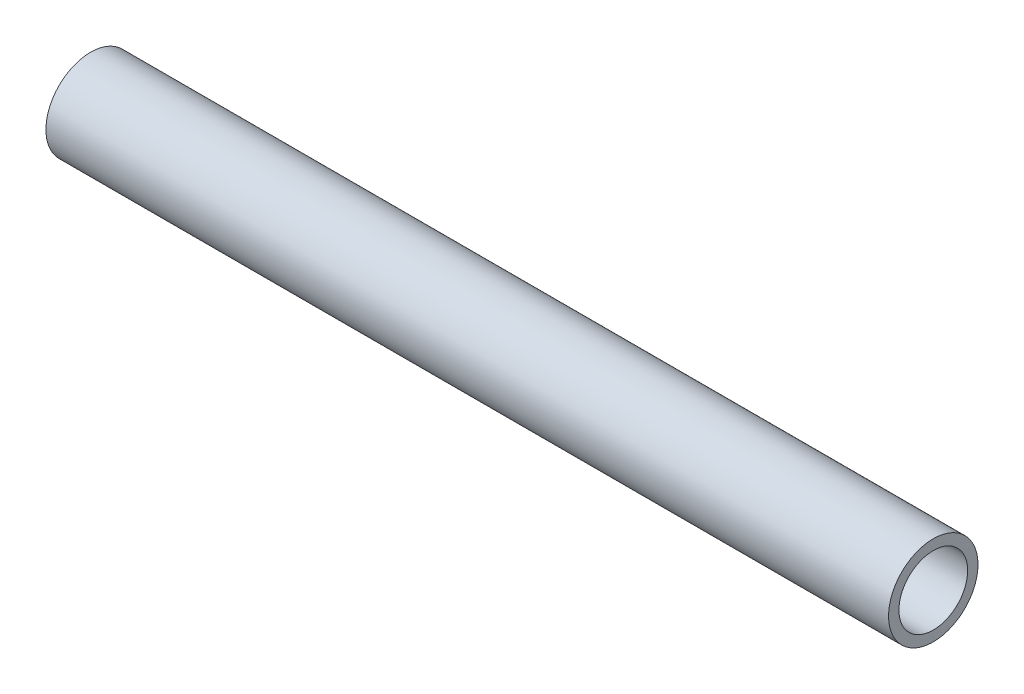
ISO-10303-21;
HEADER;
FILE_DESCRIPTION(('STEP AP214'),'2;1');
FILE_NAME('part.step','',(''),(''),'','','');
FILE_SCHEMA(('AUTOMOTIVE_DESIGN { 1 0 10303 214 1 1 1 1 }'));
ENDSEC;
DATA;
#1=APPLICATION_CONTEXT('core data for automotive mechanical design processes');
#2=APPLICATION_PROTOCOL_DEFINITION('international standard','automotive_design',2000,#1);
#3=PRODUCT_CONTEXT('',#1,'mechanical');
#4=PRODUCT('Part','Part','',(#3));
#5=PRODUCT_RELATED_PRODUCT_CATEGORY('part','',(#4));
#6=PRODUCT_DEFINITION_FORMATION('','',#4);
#7=PRODUCT_DEFINITION_CONTEXT('part definition',#1,'design');
#8=PRODUCT_DEFINITION('design','',#6,#7);
#9=PRODUCT_DEFINITION_SHAPE('','',#8);
#10=(LENGTH_UNIT() NAMED_UNIT(*) SI_UNIT(.MILLI.,.METRE.));
#11=(NAMED_UNIT(*) PLANE_ANGLE_UNIT() SI_UNIT($,.RADIAN.));
#12=(NAMED_UNIT(*) SI_UNIT($,.STERADIAN.) SOLID_ANGLE_UNIT());
#13=UNCERTAINTY_MEASURE_WITH_UNIT(LENGTH_MEASURE(1.E-05),#10,'distance_accuracy_value','');
#14=(GEOMETRIC_REPRESENTATION_CONTEXT(3) GLOBAL_UNCERTAINTY_ASSIGNED_CONTEXT((#13)) GLOBAL_UNIT_ASSIGNED_CONTEXT((#10,
#11,#12)) REPRESENTATION_CONTEXT('',''));
#15=CARTESIAN_POINT('',(0.,0.,0.));
#16=DIRECTION('',(0.,0.,1.));
#17=DIRECTION('',(1.,0.,0.));
#18=AXIS2_PLACEMENT_3D('',#15,#16,#17);
#19=CARTESIAN_POINT('',(311.15,0.,0.));
#20=DIRECTION('',(-1.,0.,0.));
#21=DIRECTION('',(0.,0.,1.));
#22=AXIS2_PLACEMENT_3D('',#19,#20,#21);
#23=CYLINDRICAL_SURFACE('',#22,12.7);
#24=CARTESIAN_POINT('',(311.15,0.,0.));
#25=DIRECTION('',(1.,0.,0.));
#26=DIRECTION('',(0.,0.,-1.));
#27=AXIS2_PLACEMENT_3D('',#24,#25,#26);
#28=CIRCLE('',#27,12.7);
#29=CARTESIAN_POINT('',(311.15,0.,-12.7));
#30=VERTEX_POINT('',#29);
#31=EDGE_CURVE('E53',#30,#30,#28,.T.);
#32=ORIENTED_EDGE('',*,*,#31,.T.);
#33=EDGE_LOOP('',(#32));
#34=FACE_BOUND('',#33,.T.);
#35=CARTESIAN_POINT('',(0.,0.,0.));
#36=DIRECTION('',(1.,0.,0.));
#37=DIRECTION('',(0.,0.,-1.));
#38=AXIS2_PLACEMENT_3D('',#35,#36,#37);
#39=CIRCLE('',#38,12.7);
#40=CARTESIAN_POINT('',(0.,0.,-12.7));
#41=VERTEX_POINT('',#40);
#42=EDGE_CURVE('E60',#41,#41,#39,.T.);
#43=ORIENTED_EDGE('',*,*,#42,.F.);
#44=EDGE_LOOP('',(#43));
#45=FACE_BOUND('',#44,.T.);
#46=ADVANCED_FACE('F45',(#34,#45),#23,.F.);
#47=CARTESIAN_POINT('',(311.15,0.,0.));
#48=DIRECTION('',(-1.,0.,0.));
#49=DIRECTION('',(0.,0.,1.));
#50=AXIS2_PLACEMENT_3D('',#47,#48,#49);
#51=CYLINDRICAL_SURFACE('',#50,16.51);
#52=CARTESIAN_POINT('',(311.15,0.,0.));
#53=DIRECTION('',(1.,0.,0.));
#54=DIRECTION('',(0.,0.,-1.));
#55=AXIS2_PLACEMENT_3D('',#52,#53,#54);
#56=CIRCLE('',#55,16.51);
#57=CARTESIAN_POINT('',(311.15,0.,-16.51));
#58=VERTEX_POINT('',#57);
#59=EDGE_CURVE('E10',#58,#58,#56,.T.);
#60=ORIENTED_EDGE('',*,*,#59,.F.);
#61=EDGE_LOOP('',(#60));
#62=FACE_BOUND('',#61,.T.);
#63=CARTESIAN_POINT('',(0.,0.,0.));
#64=DIRECTION('',(1.,0.,0.));
#65=DIRECTION('',(0.,0.,-1.));
#66=AXIS2_PLACEMENT_3D('',#63,#64,#65);
#67=CIRCLE('',#66,16.51);
#68=CARTESIAN_POINT('',(0.,0.,-16.51));
#69=VERTEX_POINT('',#68);
#70=EDGE_CURVE('E48',#69,#69,#67,.T.);
#71=ORIENTED_EDGE('',*,*,#70,.T.);
#72=EDGE_LOOP('',(#71));
#73=FACE_BOUND('',#72,.T.);
#74=ADVANCED_FACE('F69',(#62,#73),#51,.T.);
#75=CARTESIAN_POINT('',(311.15,0.,0.));
#76=DIRECTION('',(1.,0.,0.));
#77=DIRECTION('',(0.,0.,-1.));
#78=AXIS2_PLACEMENT_3D('',#75,#76,#77);
#79=PLANE('',#78);
#80=ORIENTED_EDGE('',*,*,#31,.F.);
#81=EDGE_LOOP('',(#80));
#82=FACE_BOUND('',#81,.T.);
#83=ORIENTED_EDGE('',*,*,#59,.T.);
#84=EDGE_LOOP('',(#83));
#85=FACE_BOUND('',#84,.T.);
#86=ADVANCED_FACE('F73',(#82,#85),#79,.T.);
#87=CARTESIAN_POINT('',(0.,0.,0.));
#88=DIRECTION('',(1.,0.,0.));
#89=DIRECTION('',(0.,0.,-1.));
#90=AXIS2_PLACEMENT_3D('',#87,#88,#89);
#91=PLANE('',#90);
#92=ORIENTED_EDGE('',*,*,#42,.T.);
#93=EDGE_LOOP('',(#92));
#94=FACE_BOUND('',#93,.T.);
#95=ORIENTED_EDGE('',*,*,#70,.F.);
#96=EDGE_LOOP('',(#95));
#97=FACE_BOUND('',#96,.T.);
#98=ADVANCED_FACE('F71',(#94,#97),#91,.F.);
#99=CLOSED_SHELL('',(#46,#74,#86,#98));
#100=MANIFOLD_SOLID_BREP('B2',#99);
#101=ADVANCED_BREP_SHAPE_REPRESENTATION('',(#18,#100),#14);
#102=SHAPE_DEFINITION_REPRESENTATION(#9,#101);
ENDSEC;
END-ISO-10303-21;
